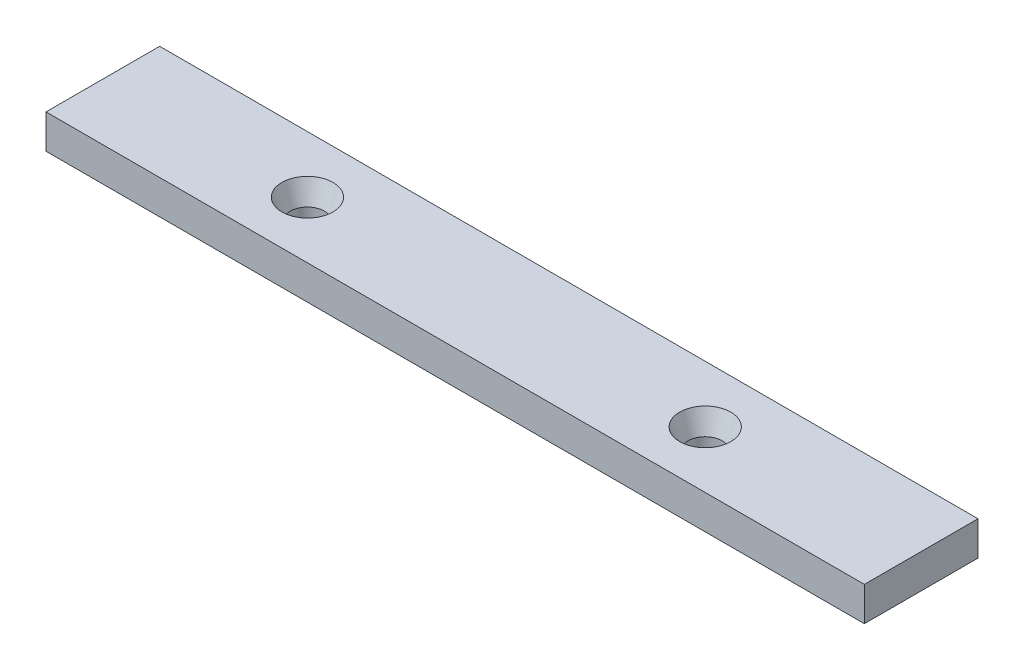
from build123d import *

# Parameters (mm, degrees)
SKETCH1_W                                    = 144
SKETCH1_H                                    = 20
BOSS_EXTRUDE1_DEPTH                          = 6
CSK_FOR_M1_6_COUNTERSUNK_FLAT_HEAD_S_2_COUNT = 2
CSK_FOR_M1_6_COUNTERSUNK_FLAT_HEAD_S_2_PITCH = 70


with BuildPart() as part:
    # Sketch1 → Boss-Extrude1 (new body)
    with BuildSketch(Plane(origin=(0, 0, 0), x_dir=(1, 0, 0), z_dir=(0, 1, 0))):
        Rectangle(SKETCH1_W, SKETCH1_H)
    extrude(amount=BOSS_EXTRUDE1_DEPTH)

    # Sketch2 → CSK for M1.6 Countersunk Flat Head Screw (revolve, cut)
    with BuildSketch(Plane(origin=(-36, 6, 0), x_dir=(0, 0, 1), z_dir=(1, 0, 0))):
        Polygon((0, 0), (0, 6), (3, 6), (3, 3.621320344), (4.5, 0), align=None)
    csk_for_m1_6_countersunk_flat_head_screw = revolve(axis=Axis((-36, 12.35, 0), (0, -1, 0)), mode=Mode.SUBTRACT)

    # CSK for M1.6 Countersunk Flat Head S 2: CSK for M1.6 Countersunk Flat Head Screw ×2
    with Locations(*[(i * CSK_FOR_M1_6_COUNTERSUNK_FLAT_HEAD_S_2_PITCH, 0, 0) for i in range(1, CSK_FOR_M1_6_COUNTERSUNK_FLAT_HEAD_S_2_COUNT)]):
        add(csk_for_m1_6_countersunk_flat_head_screw, mode=Mode.SUBTRACT)


solid = part.part
